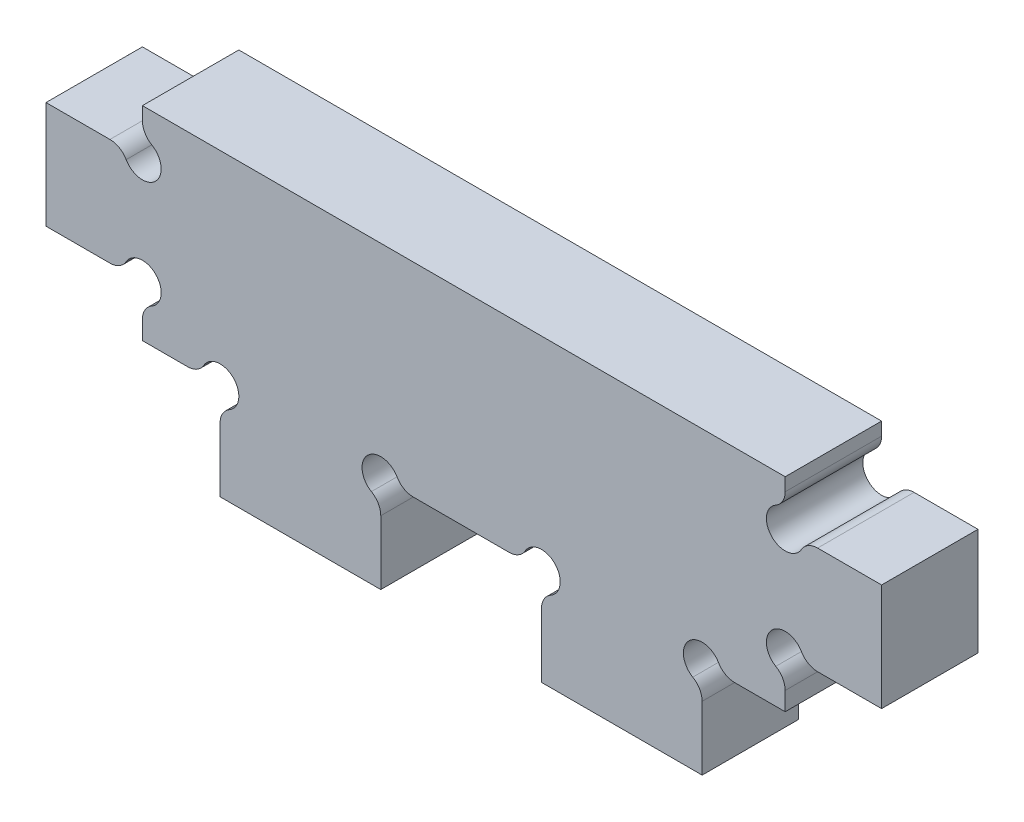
ISO-10303-21;
HEADER;
FILE_DESCRIPTION(('STEP AP214'),'2;1');
FILE_NAME('part.step','',(''),(''),'','','');
FILE_SCHEMA(('AUTOMOTIVE_DESIGN { 1 0 10303 214 1 1 1 1 }'));
ENDSEC;
DATA;
#1=APPLICATION_CONTEXT('core data for automotive mechanical design processes');
#2=APPLICATION_PROTOCOL_DEFINITION('international standard','automotive_design',2000,#1);
#3=PRODUCT_CONTEXT('',#1,'mechanical');
#4=PRODUCT('Part','Part','',(#3));
#5=PRODUCT_RELATED_PRODUCT_CATEGORY('part','',(#4));
#6=PRODUCT_DEFINITION_FORMATION('','',#4);
#7=PRODUCT_DEFINITION_CONTEXT('part definition',#1,'design');
#8=PRODUCT_DEFINITION('design','',#6,#7);
#9=PRODUCT_DEFINITION_SHAPE('','',#8);
#10=(LENGTH_UNIT() NAMED_UNIT(*) SI_UNIT(.MILLI.,.METRE.));
#11=(NAMED_UNIT(*) PLANE_ANGLE_UNIT() SI_UNIT($,.RADIAN.));
#12=(NAMED_UNIT(*) SI_UNIT($,.STERADIAN.) SOLID_ANGLE_UNIT());
#13=UNCERTAINTY_MEASURE_WITH_UNIT(LENGTH_MEASURE(1.E-05),#10,'distance_accuracy_value','');
#14=(GEOMETRIC_REPRESENTATION_CONTEXT(3) GLOBAL_UNCERTAINTY_ASSIGNED_CONTEXT((#13)) GLOBAL_UNIT_ASSIGNED_CONTEXT((#10,
#11,#12)) REPRESENTATION_CONTEXT('',''));
#15=CARTESIAN_POINT('',(0.,0.,0.));
#16=DIRECTION('',(0.,0.,1.));
#17=DIRECTION('',(1.,0.,0.));
#18=AXIS2_PLACEMENT_3D('',#15,#16,#17);
#19=CARTESIAN_POINT('',(-59.5,-19.5,18.));
#20=DIRECTION('',(0.,1.,0.));
#21=DIRECTION('',(0.,0.,1.));
#22=AXIS2_PLACEMENT_3D('',#19,#20,#21);
#23=PLANE('',#22);
#24=DIRECTION('',(1.,0.,0.));
#25=VECTOR('',#24,1.);
#26=CARTESIAN_POINT('',(-59.5,-19.5,18.));
#27=LINE('',#26,#25);
#28=CARTESIAN_POINT('',(51.0621778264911,-19.5,18.));
#29=VERTEX_POINT('',#28);
#30=CARTESIAN_POINT('',(60.5,-19.5,18.));
#31=VERTEX_POINT('',#30);
#32=EDGE_CURVE('E384',#29,#31,#27,.T.);
#33=ORIENTED_EDGE('',*,*,#32,.F.);
#34=DIRECTION('',(0.,0.,1.));
#35=VECTOR('',#34,1.);
#36=CARTESIAN_POINT('',(51.0621778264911,-19.5,18.));
#37=LINE('',#36,#35);
#38=CARTESIAN_POINT('',(51.0621778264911,-19.5,0.));
#39=VERTEX_POINT('',#38);
#40=EDGE_CURVE('E577',#29,#39,#37,.F.);
#41=ORIENTED_EDGE('',*,*,#40,.T.);
#42=DIRECTION('',(1.,0.,0.));
#43=VECTOR('',#42,1.);
#44=CARTESIAN_POINT('',(-59.5,-19.5,0.));
#45=LINE('',#44,#43);
#46=CARTESIAN_POINT('',(60.5,-19.5,0.));
#47=VERTEX_POINT('',#46);
#48=EDGE_CURVE('E413',#39,#47,#45,.T.);
#49=ORIENTED_EDGE('',*,*,#48,.T.);
#50=DIRECTION('',(0.,0.,-1.));
#51=VECTOR('',#50,1.);
#52=CARTESIAN_POINT('',(60.5,-19.5,18.));
#53=LINE('',#52,#51);
#54=EDGE_CURVE('E460',#31,#47,#53,.T.);
#55=ORIENTED_EDGE('',*,*,#54,.F.);
#56=EDGE_LOOP('',(#33,#41,#49,#55));
#57=FACE_BOUND('',#56,.T.);
#58=ADVANCED_FACE('F45',(#57),#23,.F.);
#59=CARTESIAN_POINT('',(-8.93782217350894,-19.5,0.));
#60=VERTEX_POINT('',#59);
#61=CARTESIAN_POINT('',(8.93782217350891,-19.5,0.));
#62=VERTEX_POINT('',#61);
#63=EDGE_CURVE('E418',#60,#62,#45,.T.);
#64=ORIENTED_EDGE('',*,*,#63,.T.);
#65=DIRECTION('',(0.,0.,1.));
#66=VECTOR('',#65,1.);
#67=CARTESIAN_POINT('',(8.93782217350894,-19.5,18.));
#68=LINE('',#67,#66);
#69=CARTESIAN_POINT('',(8.93782217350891,-19.5,18.));
#70=VERTEX_POINT('',#69);
#71=EDGE_CURVE('E597',#62,#70,#68,.T.);
#72=ORIENTED_EDGE('',*,*,#71,.T.);
#73=CARTESIAN_POINT('',(-8.93782217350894,-19.5,18.));
#74=VERTEX_POINT('',#73);
#75=EDGE_CURVE('E389',#74,#70,#27,.T.);
#76=ORIENTED_EDGE('',*,*,#75,.F.);
#77=DIRECTION('',(0.,0.,1.));
#78=VECTOR('',#77,1.);
#79=CARTESIAN_POINT('',(-8.93782217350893,-19.5,18.));
#80=LINE('',#79,#78);
#81=EDGE_CURVE('E594',#74,#60,#80,.F.);
#82=ORIENTED_EDGE('',*,*,#81,.T.);
#83=EDGE_LOOP('',(#64,#72,#76,#82));
#84=FACE_BOUND('',#83,.T.);
#85=ADVANCED_FACE('F758',(#84),#23,.F.);
#86=CARTESIAN_POINT('',(-59.5,-13.,18.));
#87=DIRECTION('',(1.,0.,0.));
#88=DIRECTION('',(0.,0.,-1.));
#89=AXIS2_PLACEMENT_3D('',#86,#87,#88);
#90=PLANE('',#89);
#91=DIRECTION('',(0.,-1.,0.));
#92=VECTOR('',#91,1.);
#93=CARTESIAN_POINT('',(-59.5,-13.,18.));
#94=LINE('',#93,#92);
#95=CARTESIAN_POINT('',(-59.5,-16.0621778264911,18.));
#96=VERTEX_POINT('',#95);
#97=CARTESIAN_POINT('',(-59.5,-19.5,18.));
#98=VERTEX_POINT('',#97);
#99=EDGE_CURVE('E381',#96,#98,#94,.T.);
#100=ORIENTED_EDGE('',*,*,#99,.F.);
#101=DIRECTION('',(0.,0.,1.));
#102=VECTOR('',#101,1.);
#103=CARTESIAN_POINT('',(-59.5,-16.0621778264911,18.));
#104=LINE('',#103,#102);
#105=CARTESIAN_POINT('',(-59.5,-16.0621778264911,0.));
#106=VERTEX_POINT('',#105);
#107=EDGE_CURVE('E574',#96,#106,#104,.F.);
#108=ORIENTED_EDGE('',*,*,#107,.T.);
#109=DIRECTION('',(0.,-1.,0.));
#110=VECTOR('',#109,1.);
#111=CARTESIAN_POINT('',(-59.5,-13.,0.));
#112=LINE('',#111,#110);
#113=CARTESIAN_POINT('',(-59.5,-19.5,0.));
#114=VERTEX_POINT('',#113);
#115=EDGE_CURVE('E365',#106,#114,#112,.T.);
#116=ORIENTED_EDGE('',*,*,#115,.T.);
#117=DIRECTION('',(0.,0.,-1.));
#118=VECTOR('',#117,1.);
#119=CARTESIAN_POINT('',(-59.5,-19.5,18.));
#120=LINE('',#119,#118);
#121=EDGE_CURVE('E463',#98,#114,#120,.T.);
#122=ORIENTED_EDGE('',*,*,#121,.F.);
#123=EDGE_LOOP('',(#100,#108,#116,#122));
#124=FACE_BOUND('',#123,.T.);
#125=ADVANCED_FACE('F789',(#124),#90,.F.);
#126=CARTESIAN_POINT('',(-51.0621778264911,-19.5,0.));
#127=VERTEX_POINT('',#126);
#128=EDGE_CURVE('E414',#114,#127,#45,.T.);
#129=ORIENTED_EDGE('',*,*,#128,.T.);
#130=DIRECTION('',(0.,0.,1.));
#131=VECTOR('',#130,1.);
#132=CARTESIAN_POINT('',(-51.0621778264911,-19.5,18.));
#133=LINE('',#132,#131);
#134=CARTESIAN_POINT('',(-51.0621778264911,-19.5,18.));
#135=VERTEX_POINT('',#134);
#136=EDGE_CURVE('E13',#127,#135,#133,.T.);
#137=ORIENTED_EDGE('',*,*,#136,.T.);
#138=EDGE_CURVE('E385',#98,#135,#27,.T.);
#139=ORIENTED_EDGE('',*,*,#138,.F.);
#140=ORIENTED_EDGE('',*,*,#121,.T.);
#141=EDGE_LOOP('',(#129,#137,#139,#140));
#142=FACE_BOUND('',#141,.T.);
#143=ADVANCED_FACE('F785',(#142),#23,.F.);
#144=CARTESIAN_POINT('',(60.5,-13.,18.));
#145=DIRECTION('',(-1.,0.,0.));
#146=DIRECTION('',(0.,0.,1.));
#147=AXIS2_PLACEMENT_3D('',#144,#145,#146);
#148=PLANE('',#147);
#149=DIRECTION('',(0.,1.,0.));
#150=VECTOR('',#149,1.);
#151=CARTESIAN_POINT('',(60.5,-13.,0.));
#152=LINE('',#151,#150);
#153=CARTESIAN_POINT('',(60.5,-16.0621778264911,0.));
#154=VERTEX_POINT('',#153);
#155=EDGE_CURVE('E417',#47,#154,#152,.T.);
#156=ORIENTED_EDGE('',*,*,#155,.T.);
#157=DIRECTION('',(0.,0.,1.));
#158=VECTOR('',#157,1.);
#159=CARTESIAN_POINT('',(60.5,-16.0621778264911,18.));
#160=LINE('',#159,#158);
#161=CARTESIAN_POINT('',(60.5,-16.0621778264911,18.));
#162=VERTEX_POINT('',#161);
#163=EDGE_CURVE('E544',#154,#162,#160,.T.);
#164=ORIENTED_EDGE('',*,*,#163,.T.);
#165=DIRECTION('',(0.,1.,0.));
#166=VECTOR('',#165,1.);
#167=CARTESIAN_POINT('',(60.5,-13.,18.));
#168=LINE('',#167,#166);
#169=EDGE_CURVE('E388',#31,#162,#168,.T.);
#170=ORIENTED_EDGE('',*,*,#169,.F.);
#171=ORIENTED_EDGE('',*,*,#54,.T.);
#172=EDGE_LOOP('',(#156,#164,#170,#171));
#173=FACE_BOUND('',#172,.T.);
#174=ADVANCED_FACE('F748',(#173),#148,.F.);
#175=CARTESIAN_POINT('',(78.5,-10.,18.));
#176=DIRECTION('',(0.,1.,0.));
#177=DIRECTION('',(0.,0.,1.));
#178=AXIS2_PLACEMENT_3D('',#175,#176,#177);
#179=PLANE('',#178);
#180=DIRECTION('',(1.,0.,0.));
#181=VECTOR('',#180,1.);
#182=CARTESIAN_POINT('',(60.5,-10.,18.));
#183=LINE('',#182,#181);
#184=CARTESIAN_POINT('',(66.5621778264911,-10.,18.));
#185=VERTEX_POINT('',#184);
#186=CARTESIAN_POINT('',(78.5,-10.,18.));
#187=VERTEX_POINT('',#186);
#188=EDGE_CURVE('E392',#185,#187,#183,.T.);
#189=ORIENTED_EDGE('',*,*,#188,.F.);
#190=DIRECTION('',(0.,0.,1.));
#191=VECTOR('',#190,1.);
#192=CARTESIAN_POINT('',(66.5621778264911,-10.,18.));
#193=LINE('',#192,#191);
#194=CARTESIAN_POINT('',(66.5621778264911,-10.,0.));
#195=VERTEX_POINT('',#194);
#196=EDGE_CURVE('E475',#185,#195,#193,.F.);
#197=ORIENTED_EDGE('',*,*,#196,.T.);
#198=DIRECTION('',(1.,0.,0.));
#199=VECTOR('',#198,1.);
#200=CARTESIAN_POINT('',(78.5,-10.,0.));
#201=LINE('',#200,#199);
#202=CARTESIAN_POINT('',(78.5,-10.,0.));
#203=VERTEX_POINT('',#202);
#204=EDGE_CURVE('E421',#195,#203,#201,.T.);
#205=ORIENTED_EDGE('',*,*,#204,.T.);
#206=DIRECTION('',(0.,0.,-1.));
#207=VECTOR('',#206,1.);
#208=CARTESIAN_POINT('',(78.5,-10.,18.));
#209=LINE('',#208,#207);
#210=EDGE_CURVE('E457',#187,#203,#209,.T.);
#211=ORIENTED_EDGE('',*,*,#210,.F.);
#212=EDGE_LOOP('',(#189,#197,#205,#211));
#213=FACE_BOUND('',#212,.T.);
#214=ADVANCED_FACE('F732',(#213),#179,.F.);
#215=CARTESIAN_POINT('',(78.5,-10.,18.));
#216=DIRECTION('',(-1.,0.,0.));
#217=DIRECTION('',(0.,0.,1.));
#218=AXIS2_PLACEMENT_3D('',#215,#216,#217);
#219=PLANE('',#218);
#220=DIRECTION('',(0.,1.,0.));
#221=VECTOR('',#220,1.);
#222=CARTESIAN_POINT('',(78.5,-10.,0.));
#223=LINE('',#222,#221);
#224=CARTESIAN_POINT('',(78.5,10.,0.));
#225=VERTEX_POINT('',#224);
#226=EDGE_CURVE('E423',#203,#225,#223,.T.);
#227=ORIENTED_EDGE('',*,*,#226,.T.);
#228=DIRECTION('',(0.,0.,-1.));
#229=VECTOR('',#228,1.);
#230=CARTESIAN_POINT('',(78.5,10.,18.));
#231=LINE('',#230,#229);
#232=CARTESIAN_POINT('',(78.5,10.,18.));
#233=VERTEX_POINT('',#232);
#234=EDGE_CURVE('E454',#233,#225,#231,.T.);
#235=ORIENTED_EDGE('',*,*,#234,.F.);
#236=DIRECTION('',(0.,1.,0.));
#237=VECTOR('',#236,1.);
#238=CARTESIAN_POINT('',(78.5,-10.,18.));
#239=LINE('',#238,#237);
#240=EDGE_CURVE('E394',#187,#233,#239,.T.);
#241=ORIENTED_EDGE('',*,*,#240,.F.);
#242=ORIENTED_EDGE('',*,*,#210,.T.);
#243=EDGE_LOOP('',(#227,#235,#241,#242));
#244=FACE_BOUND('',#243,.T.);
#245=ADVANCED_FACE('F727',(#244),#219,.F.);
#246=CARTESIAN_POINT('',(60.5,10.,18.));
#247=DIRECTION('',(0.,-1.,0.));
#248=DIRECTION('',(0.,0.,-1.));
#249=AXIS2_PLACEMENT_3D('',#246,#247,#248);
#250=PLANE('',#249);
#251=DIRECTION('',(-1.,0.,0.));
#252=VECTOR('',#251,1.);
#253=CARTESIAN_POINT('',(60.5,10.,0.));
#254=LINE('',#253,#252);
#255=CARTESIAN_POINT('',(66.562177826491,10.,0.));
#256=VERTEX_POINT('',#255);
#257=EDGE_CURVE('E426',#225,#256,#254,.T.);
#258=ORIENTED_EDGE('',*,*,#257,.T.);
#259=DIRECTION('',(0.,0.,1.));
#260=VECTOR('',#259,1.);
#261=CARTESIAN_POINT('',(66.562177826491,10.,18.));
#262=LINE('',#261,#260);
#263=CARTESIAN_POINT('',(66.562177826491,10.,18.));
#264=VERTEX_POINT('',#263);
#265=EDGE_CURVE('E547',#256,#264,#262,.T.);
#266=ORIENTED_EDGE('',*,*,#265,.T.);
#267=DIRECTION('',(-1.,0.,0.));
#268=VECTOR('',#267,1.);
#269=CARTESIAN_POINT('',(78.5,10.,18.));
#270=LINE('',#269,#268);
#271=EDGE_CURVE('E396',#233,#264,#270,.T.);
#272=ORIENTED_EDGE('',*,*,#271,.F.);
#273=ORIENTED_EDGE('',*,*,#234,.T.);
#274=EDGE_LOOP('',(#258,#266,#272,#273));
#275=FACE_BOUND('',#274,.T.);
#276=ADVANCED_FACE('F723',(#275),#250,.F.);
#277=CARTESIAN_POINT('',(60.5,11.6583123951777,18.));
#278=DIRECTION('',(-1.,0.,0.));
#279=DIRECTION('',(0.,0.,1.));
#280=AXIS2_PLACEMENT_3D('',#277,#278,#279);
#281=PLANE('',#280);
#282=DIRECTION('',(0.,1.,0.));
#283=VECTOR('',#282,1.);
#284=CARTESIAN_POINT('',(60.5,11.6583123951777,18.));
#285=LINE('',#284,#283);
#286=CARTESIAN_POINT('',(60.5,16.0621778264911,18.));
#287=VERTEX_POINT('',#286);
#288=CARTESIAN_POINT('',(60.5,18.5,18.));
#289=VERTEX_POINT('',#288);
#290=EDGE_CURVE('E399',#287,#289,#285,.T.);
#291=ORIENTED_EDGE('',*,*,#290,.F.);
#292=DIRECTION('',(0.,0.,1.));
#293=VECTOR('',#292,1.);
#294=CARTESIAN_POINT('',(60.5,16.0621778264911,18.));
#295=LINE('',#294,#293);
#296=CARTESIAN_POINT('',(60.5,16.0621778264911,0.));
#297=VERTEX_POINT('',#296);
#298=EDGE_CURVE('E554',#287,#297,#295,.F.);
#299=ORIENTED_EDGE('',*,*,#298,.T.);
#300=DIRECTION('',(0.,1.,0.));
#301=VECTOR('',#300,1.);
#302=CARTESIAN_POINT('',(60.5,11.6583123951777,0.));
#303=LINE('',#302,#301);
#304=CARTESIAN_POINT('',(60.5,18.5,0.));
#305=VERTEX_POINT('',#304);
#306=EDGE_CURVE('E429',#297,#305,#303,.T.);
#307=ORIENTED_EDGE('',*,*,#306,.T.);
#308=DIRECTION('',(0.,0.,-1.));
#309=VECTOR('',#308,1.);
#310=CARTESIAN_POINT('',(60.5,18.5,18.));
#311=LINE('',#310,#309);
#312=EDGE_CURVE('E451',#289,#305,#311,.T.);
#313=ORIENTED_EDGE('',*,*,#312,.F.);
#314=EDGE_LOOP('',(#291,#299,#307,#313));
#315=FACE_BOUND('',#314,.T.);
#316=ADVANCED_FACE('F707',(#315),#281,.F.);
#317=CARTESIAN_POINT('',(-59.5,18.5,18.));
#318=DIRECTION('',(0.,-1.,0.));
#319=DIRECTION('',(0.,0.,-1.));
#320=AXIS2_PLACEMENT_3D('',#317,#318,#319);
#321=PLANE('',#320);
#322=DIRECTION('',(-1.,0.,0.));
#323=VECTOR('',#322,1.);
#324=CARTESIAN_POINT('',(-59.5,18.5,0.));
#325=LINE('',#324,#323);
#326=CARTESIAN_POINT('',(-59.5,18.5,0.));
#327=VERTEX_POINT('',#326);
#328=EDGE_CURVE('E431',#305,#327,#325,.T.);
#329=ORIENTED_EDGE('',*,*,#328,.T.);
#330=DIRECTION('',(0.,0.,-1.));
#331=VECTOR('',#330,1.);
#332=CARTESIAN_POINT('',(-59.5,18.5,18.));
#333=LINE('',#332,#331);
#334=CARTESIAN_POINT('',(-59.5,18.5,18.));
#335=VERTEX_POINT('',#334);
#336=EDGE_CURVE('E448',#335,#327,#333,.T.);
#337=ORIENTED_EDGE('',*,*,#336,.F.);
#338=DIRECTION('',(-1.,0.,0.));
#339=VECTOR('',#338,1.);
#340=CARTESIAN_POINT('',(-59.5,18.5,18.));
#341=LINE('',#340,#339);
#342=EDGE_CURVE('E401',#289,#335,#341,.T.);
#343=ORIENTED_EDGE('',*,*,#342,.F.);
#344=ORIENTED_EDGE('',*,*,#312,.T.);
#345=EDGE_LOOP('',(#329,#337,#343,#344));
#346=FACE_BOUND('',#345,.T.);
#347=ADVANCED_FACE('F701',(#346),#321,.F.);
#348=CARTESIAN_POINT('',(-59.5,11.6583123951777,18.));
#349=DIRECTION('',(1.,0.,0.));
#350=DIRECTION('',(0.,0.,-1.));
#351=AXIS2_PLACEMENT_3D('',#348,#349,#350);
#352=PLANE('',#351);
#353=DIRECTION('',(0.,-1.,0.));
#354=VECTOR('',#353,1.);
#355=CARTESIAN_POINT('',(-59.5,11.6583123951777,0.));
#356=LINE('',#355,#354);
#357=CARTESIAN_POINT('',(-59.5,16.0621778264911,0.));
#358=VERTEX_POINT('',#357);
#359=EDGE_CURVE('E434',#327,#358,#356,.T.);
#360=ORIENTED_EDGE('',*,*,#359,.T.);
#361=DIRECTION('',(0.,0.,1.));
#362=VECTOR('',#361,1.);
#363=CARTESIAN_POINT('',(-59.5,16.0621778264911,18.));
#364=LINE('',#363,#362);
#365=CARTESIAN_POINT('',(-59.5,16.0621778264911,18.));
#366=VERTEX_POINT('',#365);
#367=EDGE_CURVE('E557',#358,#366,#364,.T.);
#368=ORIENTED_EDGE('',*,*,#367,.T.);
#369=DIRECTION('',(0.,-1.,0.));
#370=VECTOR('',#369,1.);
#371=CARTESIAN_POINT('',(-59.5,11.6583123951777,18.));
#372=LINE('',#371,#370);
#373=EDGE_CURVE('E403',#335,#366,#372,.T.);
#374=ORIENTED_EDGE('',*,*,#373,.F.);
#375=ORIENTED_EDGE('',*,*,#336,.T.);
#376=EDGE_LOOP('',(#360,#368,#374,#375));
#377=FACE_BOUND('',#376,.T.);
#378=ADVANCED_FACE('F696',(#377),#352,.F.);
#379=CARTESIAN_POINT('',(-77.5,10.,18.));
#380=DIRECTION('',(0.,-1.,0.));
#381=DIRECTION('',(0.,0.,-1.));
#382=AXIS2_PLACEMENT_3D('',#379,#380,#381);
#383=PLANE('',#382);
#384=DIRECTION('',(-1.,0.,0.));
#385=VECTOR('',#384,1.);
#386=CARTESIAN_POINT('',(-59.5,10.,18.));
#387=LINE('',#386,#385);
#388=CARTESIAN_POINT('',(-65.5621778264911,10.,18.));
#389=VERTEX_POINT('',#388);
#390=CARTESIAN_POINT('',(-77.5,10.,18.));
#391=VERTEX_POINT('',#390);
#392=EDGE_CURVE('E406',#389,#391,#387,.T.);
#393=ORIENTED_EDGE('',*,*,#392,.F.);
#394=DIRECTION('',(0.,0.,1.));
#395=VECTOR('',#394,1.);
#396=CARTESIAN_POINT('',(-65.5621778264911,10.,18.));
#397=LINE('',#396,#395);
#398=CARTESIAN_POINT('',(-65.5621778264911,10.,0.));
#399=VERTEX_POINT('',#398);
#400=EDGE_CURVE('E564',#389,#399,#397,.F.);
#401=ORIENTED_EDGE('',*,*,#400,.T.);
#402=DIRECTION('',(-1.,0.,0.));
#403=VECTOR('',#402,1.);
#404=CARTESIAN_POINT('',(-77.5,10.,0.));
#405=LINE('',#404,#403);
#406=CARTESIAN_POINT('',(-77.5,10.,0.));
#407=VERTEX_POINT('',#406);
#408=EDGE_CURVE('E437',#399,#407,#405,.T.);
#409=ORIENTED_EDGE('',*,*,#408,.T.);
#410=DIRECTION('',(0.,0.,-1.));
#411=VECTOR('',#410,1.);
#412=CARTESIAN_POINT('',(-77.5,10.,18.));
#413=LINE('',#412,#411);
#414=EDGE_CURVE('E445',#391,#407,#413,.T.);
#415=ORIENTED_EDGE('',*,*,#414,.F.);
#416=EDGE_LOOP('',(#393,#401,#409,#415));
#417=FACE_BOUND('',#416,.T.);
#418=ADVANCED_FACE('F898',(#417),#383,.F.);
#419=CARTESIAN_POINT('',(-77.5,-10.,18.));
#420=DIRECTION('',(1.,0.,0.));
#421=DIRECTION('',(0.,0.,-1.));
#422=AXIS2_PLACEMENT_3D('',#419,#420,#421);
#423=PLANE('',#422);
#424=DIRECTION('',(0.,-1.,0.));
#425=VECTOR('',#424,1.);
#426=CARTESIAN_POINT('',(-77.5,-10.,0.));
#427=LINE('',#426,#425);
#428=CARTESIAN_POINT('',(-77.5,-10.,0.));
#429=VERTEX_POINT('',#428);
#430=EDGE_CURVE('E439',#407,#429,#427,.T.);
#431=ORIENTED_EDGE('',*,*,#430,.T.);
#432=DIRECTION('',(0.,0.,-1.));
#433=VECTOR('',#432,1.);
#434=CARTESIAN_POINT('',(-77.5,-10.,18.));
#435=LINE('',#434,#433);
#436=CARTESIAN_POINT('',(-77.5,-10.,18.));
#437=VERTEX_POINT('',#436);
#438=EDGE_CURVE('E411',#437,#429,#435,.T.);
#439=ORIENTED_EDGE('',*,*,#438,.F.);
#440=DIRECTION('',(0.,-1.,0.));
#441=VECTOR('',#440,1.);
#442=CARTESIAN_POINT('',(-77.5,-10.,18.));
#443=LINE('',#442,#441);
#444=EDGE_CURVE('E408',#391,#437,#443,.T.);
#445=ORIENTED_EDGE('',*,*,#444,.F.);
#446=ORIENTED_EDGE('',*,*,#414,.T.);
#447=EDGE_LOOP('',(#431,#439,#445,#446));
#448=FACE_BOUND('',#447,.T.);
#449=ADVANCED_FACE('F894',(#448),#423,.F.);
#450=CARTESIAN_POINT('',(-77.5,-10.,18.));
#451=DIRECTION('',(0.,1.,0.));
#452=DIRECTION('',(0.,0.,1.));
#453=AXIS2_PLACEMENT_3D('',#450,#451,#452);
#454=PLANE('',#453);
#455=DIRECTION('',(1.,0.,0.));
#456=VECTOR('',#455,1.);
#457=CARTESIAN_POINT('',(-77.5,-10.,0.));
#458=LINE('',#457,#456);
#459=CARTESIAN_POINT('',(-65.5621778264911,-10.,0.));
#460=VERTEX_POINT('',#459);
#461=EDGE_CURVE('E382',#429,#460,#458,.T.);
#462=ORIENTED_EDGE('',*,*,#461,.T.);
#463=DIRECTION('',(0.,0.,1.));
#464=VECTOR('',#463,1.);
#465=CARTESIAN_POINT('',(-65.5621778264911,-10.,18.));
#466=LINE('',#465,#464);
#467=CARTESIAN_POINT('',(-65.5621778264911,-10.,18.));
#468=VERTEX_POINT('',#467);
#469=EDGE_CURVE('E567',#460,#468,#466,.T.);
#470=ORIENTED_EDGE('',*,*,#469,.T.);
#471=DIRECTION('',(1.,0.,0.));
#472=VECTOR('',#471,1.);
#473=CARTESIAN_POINT('',(-62.5,-10.,18.));
#474=LINE('',#473,#472);
#475=EDGE_CURVE('E378',#437,#468,#474,.T.);
#476=ORIENTED_EDGE('',*,*,#475,.F.);
#477=ORIENTED_EDGE('',*,*,#438,.T.);
#478=EDGE_LOOP('',(#462,#470,#476,#477));
#479=FACE_BOUND('',#478,.T.);
#480=ADVANCED_FACE('F889',(#479),#454,.F.);
#481=CARTESIAN_POINT('',(0.,0.,18.));
#482=DIRECTION('',(0.,0.,1.));
#483=DIRECTION('',(1.,0.,0.));
#484=AXIS2_PLACEMENT_3D('',#481,#482,#483);
#485=PLANE('',#484);
#486=CARTESIAN_POINT('',(60.5,-10.,18.));
#487=DIRECTION('',(0.,0.,1.));
#488=DIRECTION('',(1.,0.,0.));
#489=AXIS2_PLACEMENT_3D('',#486,#487,#488);
#490=CIRCLE('',#489,3.50000000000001);
#491=CARTESIAN_POINT('',(63.5310889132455,-8.25,18.));
#492=VERTEX_POINT('',#491);
#493=CARTESIAN_POINT('',(58.75,-13.0310889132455,18.));
#494=VERTEX_POINT('',#493);
#495=EDGE_CURVE('E674',#492,#494,#490,.T.);
#496=ORIENTED_EDGE('',*,*,#495,.F.);
#497=CARTESIAN_POINT('',(66.5621778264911,-6.5,18.));
#498=DIRECTION('',(0.,0.,1.));
#499=DIRECTION('',(1.,0.,0.));
#500=AXIS2_PLACEMENT_3D('',#497,#498,#499);
#501=CIRCLE('',#500,3.5);
#502=EDGE_CURVE('E542',#492,#185,#501,.T.);
#503=ORIENTED_EDGE('',*,*,#502,.T.);
#504=ORIENTED_EDGE('',*,*,#188,.T.);
#505=ORIENTED_EDGE('',*,*,#240,.T.);
#506=ORIENTED_EDGE('',*,*,#271,.T.);
#507=CARTESIAN_POINT('',(66.562177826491,6.5,18.));
#508=DIRECTION('',(0.,0.,1.));
#509=DIRECTION('',(1.,0.,0.));
#510=AXIS2_PLACEMENT_3D('',#507,#508,#509);
#511=CIRCLE('',#510,3.5);
#512=CARTESIAN_POINT('',(63.5310889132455,8.24999999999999,18.));
#513=VERTEX_POINT('',#512);
#514=EDGE_CURVE('E538',#264,#513,#511,.T.);
#515=ORIENTED_EDGE('',*,*,#514,.T.);
#516=CARTESIAN_POINT('',(60.5,10.,18.));
#517=DIRECTION('',(0.,0.,1.));
#518=DIRECTION('',(1.,0.,0.));
#519=AXIS2_PLACEMENT_3D('',#516,#517,#518);
#520=CIRCLE('',#519,3.50000000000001);
#521=CARTESIAN_POINT('',(58.75,13.0310889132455,18.));
#522=VERTEX_POINT('',#521);
#523=EDGE_CURVE('E677',#522,#513,#520,.T.);
#524=ORIENTED_EDGE('',*,*,#523,.F.);
#525=CARTESIAN_POINT('',(57.,16.0621778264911,18.));
#526=DIRECTION('',(0.,0.,1.));
#527=DIRECTION('',(1.,0.,0.));
#528=AXIS2_PLACEMENT_3D('',#525,#526,#527);
#529=CIRCLE('',#528,3.5);
#530=EDGE_CURVE('E536',#522,#287,#529,.T.);
#531=ORIENTED_EDGE('',*,*,#530,.T.);
#532=ORIENTED_EDGE('',*,*,#290,.T.);
#533=ORIENTED_EDGE('',*,*,#342,.T.);
#534=ORIENTED_EDGE('',*,*,#373,.T.);
#535=CARTESIAN_POINT('',(-56.,16.0621778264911,18.));
#536=DIRECTION('',(0.,0.,1.));
#537=DIRECTION('',(1.,0.,0.));
#538=AXIS2_PLACEMENT_3D('',#535,#536,#537);
#539=CIRCLE('',#538,3.5);
#540=CARTESIAN_POINT('',(-57.75,13.0310889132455,18.));
#541=VERTEX_POINT('',#540);
#542=EDGE_CURVE('E534',#366,#541,#539,.T.);
#543=ORIENTED_EDGE('',*,*,#542,.T.);
#544=CARTESIAN_POINT('',(-59.5,10.,18.));
#545=DIRECTION('',(0.,0.,1.));
#546=DIRECTION('',(1.,0.,0.));
#547=AXIS2_PLACEMENT_3D('',#544,#545,#546);
#548=CIRCLE('',#547,3.5);
#549=CARTESIAN_POINT('',(-62.5310889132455,8.25,18.));
#550=VERTEX_POINT('',#549);
#551=EDGE_CURVE('E632',#550,#541,#548,.T.);
#552=ORIENTED_EDGE('',*,*,#551,.F.);
#553=CARTESIAN_POINT('',(-65.5621778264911,6.5,18.));
#554=DIRECTION('',(0.,0.,1.));
#555=DIRECTION('',(1.,0.,0.));
#556=AXIS2_PLACEMENT_3D('',#553,#554,#555);
#557=CIRCLE('',#556,3.5);
#558=EDGE_CURVE('E532',#550,#389,#557,.T.);
#559=ORIENTED_EDGE('',*,*,#558,.T.);
#560=ORIENTED_EDGE('',*,*,#392,.T.);
#561=ORIENTED_EDGE('',*,*,#444,.T.);
#562=ORIENTED_EDGE('',*,*,#475,.T.);
#563=CARTESIAN_POINT('',(-65.5621778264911,-6.5,18.));
#564=DIRECTION('',(0.,0.,1.));
#565=DIRECTION('',(1.,0.,0.));
#566=AXIS2_PLACEMENT_3D('',#563,#564,#565);
#567=CIRCLE('',#566,3.5);
#568=CARTESIAN_POINT('',(-62.5310889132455,-8.25,18.));
#569=VERTEX_POINT('',#568);
#570=EDGE_CURVE('E530',#468,#569,#567,.T.);
#571=ORIENTED_EDGE('',*,*,#570,.T.);
#572=CARTESIAN_POINT('',(-59.5,-10.,18.));
#573=DIRECTION('',(0.,0.,1.));
#574=DIRECTION('',(1.,0.,0.));
#575=AXIS2_PLACEMENT_3D('',#572,#573,#574);
#576=CIRCLE('',#575,3.5);
#577=CARTESIAN_POINT('',(-57.75,-13.0310889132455,18.));
#578=VERTEX_POINT('',#577);
#579=EDGE_CURVE('E680',#578,#569,#576,.T.);
#580=ORIENTED_EDGE('',*,*,#579,.F.);
#581=CARTESIAN_POINT('',(-56.,-16.0621778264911,18.));
#582=DIRECTION('',(0.,0.,1.));
#583=DIRECTION('',(1.,0.,0.));
#584=AXIS2_PLACEMENT_3D('',#581,#582,#583);
#585=CIRCLE('',#584,3.5);
#586=EDGE_CURVE('E528',#578,#96,#585,.T.);
#587=ORIENTED_EDGE('',*,*,#586,.T.);
#588=ORIENTED_EDGE('',*,*,#99,.T.);
#589=ORIENTED_EDGE('',*,*,#138,.T.);
#590=CARTESIAN_POINT('',(-51.0621778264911,-16.,18.));
#591=DIRECTION('',(0.,0.,1.));
#592=DIRECTION('',(1.,0.,0.));
#593=AXIS2_PLACEMENT_3D('',#590,#591,#592);
#594=CIRCLE('',#593,3.5);
#595=CARTESIAN_POINT('',(-48.0310889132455,-17.75,18.));
#596=VERTEX_POINT('',#595);
#597=EDGE_CURVE('E514',#135,#596,#594,.T.);
#598=ORIENTED_EDGE('',*,*,#597,.T.);
#599=CARTESIAN_POINT('',(-45.,-19.5,18.));
#600=DIRECTION('',(0.,0.,1.));
#601=DIRECTION('',(1.,0.,0.));
#602=AXIS2_PLACEMENT_3D('',#599,#600,#601);
#603=CIRCLE('',#602,3.5);
#604=CARTESIAN_POINT('',(-43.25,-22.5310889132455,18.));
#605=VERTEX_POINT('',#604);
#606=EDGE_CURVE('E628',#605,#596,#603,.T.);
#607=ORIENTED_EDGE('',*,*,#606,.F.);
#608=CARTESIAN_POINT('',(-41.5,-25.5621778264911,18.));
#609=DIRECTION('',(0.,0.,1.));
#610=DIRECTION('',(1.,0.,0.));
#611=AXIS2_PLACEMENT_3D('',#608,#609,#610);
#612=CIRCLE('',#611,3.5);
#613=CARTESIAN_POINT('',(-45.,-25.5621778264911,18.));
#614=VERTEX_POINT('',#613);
#615=EDGE_CURVE('E68',#605,#614,#612,.T.);
#616=ORIENTED_EDGE('',*,*,#615,.T.);
#617=DIRECTION('',(0.,-1.,0.));
#618=VECTOR('',#617,1.);
#619=CARTESIAN_POINT('',(-45.,-1.5,18.));
#620=LINE('',#619,#618);
#621=CARTESIAN_POINT('',(-45.,-37.5,18.));
#622=VERTEX_POINT('',#621);
#623=EDGE_CURVE('E368',#614,#622,#620,.T.);
#624=ORIENTED_EDGE('',*,*,#623,.T.);
#625=DIRECTION('',(1.,0.,0.));
#626=VECTOR('',#625,1.);
#627=CARTESIAN_POINT('',(-45.,-37.5,18.));
#628=LINE('',#627,#626);
#629=CARTESIAN_POINT('',(-15.,-37.5,18.));
#630=VERTEX_POINT('',#629);
#631=EDGE_CURVE('E371',#622,#630,#628,.T.);
#632=ORIENTED_EDGE('',*,*,#631,.T.);
#633=DIRECTION('',(0.,1.,0.));
#634=VECTOR('',#633,1.);
#635=CARTESIAN_POINT('',(-15.,-1.5,18.));
#636=LINE('',#635,#634);
#637=CARTESIAN_POINT('',(-15.,-25.5621778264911,18.));
#638=VERTEX_POINT('',#637);
#639=EDGE_CURVE('E366',#630,#638,#636,.T.);
#640=ORIENTED_EDGE('',*,*,#639,.T.);
#641=CARTESIAN_POINT('',(-18.5,-25.5621778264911,18.));
#642=DIRECTION('',(0.,0.,1.));
#643=DIRECTION('',(1.,0.,0.));
#644=AXIS2_PLACEMENT_3D('',#641,#642,#643);
#645=CIRCLE('',#644,3.5);
#646=CARTESIAN_POINT('',(-16.75,-22.5310889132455,18.));
#647=VERTEX_POINT('',#646);
#648=EDGE_CURVE('E517',#638,#647,#645,.T.);
#649=ORIENTED_EDGE('',*,*,#648,.T.);
#650=CARTESIAN_POINT('',(-15.,-19.5,18.));
#651=DIRECTION('',(0.,0.,1.));
#652=DIRECTION('',(1.,0.,0.));
#653=AXIS2_PLACEMENT_3D('',#650,#651,#652);
#654=CIRCLE('',#653,3.5);
#655=CARTESIAN_POINT('',(-11.9689110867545,-17.75,18.));
#656=VERTEX_POINT('',#655);
#657=EDGE_CURVE('E671',#656,#647,#654,.T.);
#658=ORIENTED_EDGE('',*,*,#657,.F.);
#659=CARTESIAN_POINT('',(-8.93782217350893,-16.,18.));
#660=DIRECTION('',(0.,0.,1.));
#661=DIRECTION('',(1.,0.,0.));
#662=AXIS2_PLACEMENT_3D('',#659,#660,#661);
#663=CIRCLE('',#662,3.5);
#664=EDGE_CURVE('E519',#656,#74,#663,.T.);
#665=ORIENTED_EDGE('',*,*,#664,.T.);
#666=ORIENTED_EDGE('',*,*,#75,.T.);
#667=CARTESIAN_POINT('',(8.93782217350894,-16.,18.));
#668=DIRECTION('',(0.,0.,1.));
#669=DIRECTION('',(1.,0.,0.));
#670=AXIS2_PLACEMENT_3D('',#667,#668,#669);
#671=CIRCLE('',#670,3.5);
#672=CARTESIAN_POINT('',(11.9689110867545,-17.75,18.));
#673=VERTEX_POINT('',#672);
#674=EDGE_CURVE('E521',#70,#673,#671,.T.);
#675=ORIENTED_EDGE('',*,*,#674,.T.);
#676=CARTESIAN_POINT('',(15.,-19.5,18.));
#677=DIRECTION('',(0.,0.,1.));
#678=DIRECTION('',(1.,0.,0.));
#679=AXIS2_PLACEMENT_3D('',#676,#677,#678);
#680=CIRCLE('',#679,3.5);
#681=CARTESIAN_POINT('',(16.75,-22.5310889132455,18.));
#682=VERTEX_POINT('',#681);
#683=EDGE_CURVE('E667',#682,#673,#680,.T.);
#684=ORIENTED_EDGE('',*,*,#683,.F.);
#685=CARTESIAN_POINT('',(18.5,-25.5621778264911,18.));
#686=DIRECTION('',(0.,0.,1.));
#687=DIRECTION('',(1.,0.,0.));
#688=AXIS2_PLACEMENT_3D('',#685,#686,#687);
#689=CIRCLE('',#688,3.5);
#690=CARTESIAN_POINT('',(15.,-25.5621778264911,18.));
#691=VERTEX_POINT('',#690);
#692=EDGE_CURVE('E335',#682,#691,#689,.T.);
#693=ORIENTED_EDGE('',*,*,#692,.T.);
#694=DIRECTION('',(0.,-1.,0.));
#695=VECTOR('',#694,1.);
#696=CARTESIAN_POINT('',(15.,-1.5,18.));
#697=LINE('',#696,#695);
#698=CARTESIAN_POINT('',(15.,-37.5,18.));
#699=VERTEX_POINT('',#698);
#700=EDGE_CURVE('E327',#691,#699,#697,.T.);
#701=ORIENTED_EDGE('',*,*,#700,.T.);
#702=DIRECTION('',(1.,0.,0.));
#703=VECTOR('',#702,1.);
#704=CARTESIAN_POINT('',(45.,-37.5,18.));
#705=LINE('',#704,#703);
#706=CARTESIAN_POINT('',(45.,-37.5,18.));
#707=VERTEX_POINT('',#706);
#708=EDGE_CURVE('E333',#699,#707,#705,.T.);
#709=ORIENTED_EDGE('',*,*,#708,.T.);
#710=DIRECTION('',(0.,1.,0.));
#711=VECTOR('',#710,1.);
#712=CARTESIAN_POINT('',(45.,-1.5,18.));
#713=LINE('',#712,#711);
#714=CARTESIAN_POINT('',(45.,-25.5621778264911,18.));
#715=VERTEX_POINT('',#714);
#716=EDGE_CURVE('E338',#707,#715,#713,.T.);
#717=ORIENTED_EDGE('',*,*,#716,.T.);
#718=CARTESIAN_POINT('',(41.5,-25.5621778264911,18.));
#719=DIRECTION('',(0.,0.,1.));
#720=DIRECTION('',(1.,0.,0.));
#721=AXIS2_PLACEMENT_3D('',#718,#719,#720);
#722=CIRCLE('',#721,3.5);
#723=CARTESIAN_POINT('',(43.25,-22.5310889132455,18.));
#724=VERTEX_POINT('',#723);
#725=EDGE_CURVE('E524',#715,#724,#722,.T.);
#726=ORIENTED_EDGE('',*,*,#725,.T.);
#727=CARTESIAN_POINT('',(45.,-19.5,18.));
#728=DIRECTION('',(0.,0.,1.));
#729=DIRECTION('',(1.,0.,0.));
#730=AXIS2_PLACEMENT_3D('',#727,#728,#729);
#731=CIRCLE('',#730,3.5);
#732=CARTESIAN_POINT('',(48.0310889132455,-17.75,18.));
#733=VERTEX_POINT('',#732);
#734=EDGE_CURVE('E655',#733,#724,#731,.T.);
#735=ORIENTED_EDGE('',*,*,#734,.F.);
#736=CARTESIAN_POINT('',(51.0621778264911,-16.,18.));
#737=DIRECTION('',(0.,0.,1.));
#738=DIRECTION('',(1.,0.,0.));
#739=AXIS2_PLACEMENT_3D('',#736,#737,#738);
#740=CIRCLE('',#739,3.5);
#741=EDGE_CURVE('E526',#733,#29,#740,.T.);
#742=ORIENTED_EDGE('',*,*,#741,.T.);
#743=ORIENTED_EDGE('',*,*,#32,.T.);
#744=ORIENTED_EDGE('',*,*,#169,.T.);
#745=CARTESIAN_POINT('',(57.,-16.0621778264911,18.));
#746=DIRECTION('',(0.,0.,1.));
#747=DIRECTION('',(1.,0.,0.));
#748=AXIS2_PLACEMENT_3D('',#745,#746,#747);
#749=CIRCLE('',#748,3.5);
#750=EDGE_CURVE('E540',#162,#494,#749,.T.);
#751=ORIENTED_EDGE('',*,*,#750,.T.);
#752=EDGE_LOOP('',(#496,#503,#504,#505,#506,#515,#524,#531,#532,#533,#534,#543,#552,#559,#560,
#561,#562,#571,#580,#587,#588,#589,#598,#607,#616,#624,#632,#640,#649,#658,#665,#666,#675,#684,
#693,#701,#709,#717,#726,#735,#742,#743,#744,#751));
#753=FACE_BOUND('',#752,.T.);
#754=ADVANCED_FACE('F330',(#753),#485,.T.);
#755=CARTESIAN_POINT('',(0.,0.,0.));
#756=DIRECTION('',(0.,0.,1.));
#757=DIRECTION('',(1.,0.,0.));
#758=AXIS2_PLACEMENT_3D('',#755,#756,#757);
#759=PLANE('',#758);
#760=ORIENTED_EDGE('',*,*,#204,.F.);
#761=CARTESIAN_POINT('',(66.5621778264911,-6.5,0.));
#762=DIRECTION('',(0.,0.,1.));
#763=DIRECTION('',(1.,0.,0.));
#764=AXIS2_PLACEMENT_3D('',#761,#762,#763);
#765=CIRCLE('',#764,3.5);
#766=CARTESIAN_POINT('',(63.5310889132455,-8.25,0.));
#767=VERTEX_POINT('',#766);
#768=EDGE_CURVE('E508',#195,#767,#765,.F.);
#769=ORIENTED_EDGE('',*,*,#768,.T.);
#770=CARTESIAN_POINT('',(60.5,-10.,0.));
#771=DIRECTION('',(0.,0.,1.));
#772=DIRECTION('',(1.,0.,0.));
#773=AXIS2_PLACEMENT_3D('',#770,#771,#772);
#774=CIRCLE('',#773,3.50000000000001);
#775=CARTESIAN_POINT('',(58.75,-13.0310889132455,0.));
#776=VERTEX_POINT('',#775);
#777=EDGE_CURVE('E658',#767,#776,#774,.T.);
#778=ORIENTED_EDGE('',*,*,#777,.T.);
#779=CARTESIAN_POINT('',(57.,-16.0621778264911,0.));
#780=DIRECTION('',(0.,0.,1.));
#781=DIRECTION('',(1.,0.,0.));
#782=AXIS2_PLACEMENT_3D('',#779,#780,#781);
#783=CIRCLE('',#782,3.5);
#784=EDGE_CURVE('E506',#776,#154,#783,.F.);
#785=ORIENTED_EDGE('',*,*,#784,.T.);
#786=ORIENTED_EDGE('',*,*,#155,.F.);
#787=ORIENTED_EDGE('',*,*,#48,.F.);
#788=CARTESIAN_POINT('',(51.0621778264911,-16.,0.));
#789=DIRECTION('',(0.,0.,1.));
#790=DIRECTION('',(1.,0.,0.));
#791=AXIS2_PLACEMENT_3D('',#788,#789,#790);
#792=CIRCLE('',#791,3.5);
#793=CARTESIAN_POINT('',(48.0310889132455,-17.75,0.));
#794=VERTEX_POINT('',#793);
#795=EDGE_CURVE('E492',#39,#794,#792,.F.);
#796=ORIENTED_EDGE('',*,*,#795,.T.);
#797=CARTESIAN_POINT('',(45.,-19.5,0.));
#798=DIRECTION('',(0.,0.,1.));
#799=DIRECTION('',(1.,0.,0.));
#800=AXIS2_PLACEMENT_3D('',#797,#798,#799);
#801=CIRCLE('',#800,3.5);
#802=CARTESIAN_POINT('',(43.25,-22.5310889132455,0.));
#803=VERTEX_POINT('',#802);
#804=EDGE_CURVE('E653',#794,#803,#801,.T.);
#805=ORIENTED_EDGE('',*,*,#804,.T.);
#806=CARTESIAN_POINT('',(41.5,-25.5621778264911,0.));
#807=DIRECTION('',(0.,0.,1.));
#808=DIRECTION('',(1.,0.,0.));
#809=AXIS2_PLACEMENT_3D('',#806,#807,#808);
#810=CIRCLE('',#809,3.5);
#811=CARTESIAN_POINT('',(45.,-25.5621778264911,0.));
#812=VERTEX_POINT('',#811);
#813=EDGE_CURVE('E490',#803,#812,#810,.F.);
#814=ORIENTED_EDGE('',*,*,#813,.T.);
#815=DIRECTION('',(0.,-1.,0.));
#816=VECTOR('',#815,1.);
#817=CARTESIAN_POINT('',(45.,-1.5,0.));
#818=LINE('',#817,#816);
#819=CARTESIAN_POINT('',(45.,-37.5,0.));
#820=VERTEX_POINT('',#819);
#821=EDGE_CURVE('E369',#812,#820,#818,.T.);
#822=ORIENTED_EDGE('',*,*,#821,.T.);
#823=DIRECTION('',(-1.,0.,0.));
#824=VECTOR('',#823,1.);
#825=CARTESIAN_POINT('',(45.,-37.5,0.));
#826=LINE('',#825,#824);
#827=CARTESIAN_POINT('',(15.,-37.5,0.));
#828=VERTEX_POINT('',#827);
#829=EDGE_CURVE('E637',#820,#828,#826,.T.);
#830=ORIENTED_EDGE('',*,*,#829,.T.);
#831=DIRECTION('',(0.,1.,0.));
#832=VECTOR('',#831,1.);
#833=CARTESIAN_POINT('',(15.,-1.5,0.));
#834=LINE('',#833,#832);
#835=CARTESIAN_POINT('',(15.,-25.5621778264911,0.));
#836=VERTEX_POINT('',#835);
#837=EDGE_CURVE('E345',#828,#836,#834,.T.);
#838=ORIENTED_EDGE('',*,*,#837,.T.);
#839=CARTESIAN_POINT('',(18.5,-25.5621778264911,0.));
#840=DIRECTION('',(0.,0.,1.));
#841=DIRECTION('',(1.,0.,0.));
#842=AXIS2_PLACEMENT_3D('',#839,#840,#841);
#843=CIRCLE('',#842,3.5);
#844=CARTESIAN_POINT('',(16.75,-22.5310889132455,0.));
#845=VERTEX_POINT('',#844);
#846=EDGE_CURVE('E488',#836,#845,#843,.F.);
#847=ORIENTED_EDGE('',*,*,#846,.T.);
#848=CARTESIAN_POINT('',(15.,-19.5,0.));
#849=DIRECTION('',(0.,0.,1.));
#850=DIRECTION('',(1.,0.,0.));
#851=AXIS2_PLACEMENT_3D('',#848,#849,#850);
#852=CIRCLE('',#851,3.5);
#853=CARTESIAN_POINT('',(11.9689110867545,-17.75,0.));
#854=VERTEX_POINT('',#853);
#855=EDGE_CURVE('E657',#845,#854,#852,.T.);
#856=ORIENTED_EDGE('',*,*,#855,.T.);
#857=CARTESIAN_POINT('',(8.93782217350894,-16.,0.));
#858=DIRECTION('',(0.,0.,1.));
#859=DIRECTION('',(1.,0.,0.));
#860=AXIS2_PLACEMENT_3D('',#857,#858,#859);
#861=CIRCLE('',#860,3.5);
#862=EDGE_CURVE('E486',#854,#62,#861,.F.);
#863=ORIENTED_EDGE('',*,*,#862,.T.);
#864=ORIENTED_EDGE('',*,*,#63,.F.);
#865=CARTESIAN_POINT('',(-8.93782217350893,-16.,0.));
#866=DIRECTION('',(0.,0.,1.));
#867=DIRECTION('',(1.,0.,0.));
#868=AXIS2_PLACEMENT_3D('',#865,#866,#867);
#869=CIRCLE('',#868,3.5);
#870=CARTESIAN_POINT('',(-11.9689110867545,-17.75,0.));
#871=VERTEX_POINT('',#870);
#872=EDGE_CURVE('E484',#60,#871,#869,.F.);
#873=ORIENTED_EDGE('',*,*,#872,.T.);
#874=CARTESIAN_POINT('',(-15.,-19.5,0.));
#875=DIRECTION('',(0.,0.,1.));
#876=DIRECTION('',(1.,0.,0.));
#877=AXIS2_PLACEMENT_3D('',#874,#875,#876);
#878=CIRCLE('',#877,3.5);
#879=CARTESIAN_POINT('',(-16.75,-22.5310889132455,0.));
#880=VERTEX_POINT('',#879);
#881=EDGE_CURVE('E661',#871,#880,#878,.T.);
#882=ORIENTED_EDGE('',*,*,#881,.T.);
#883=CARTESIAN_POINT('',(-18.5,-25.5621778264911,0.));
#884=DIRECTION('',(0.,0.,1.));
#885=DIRECTION('',(1.,0.,0.));
#886=AXIS2_PLACEMENT_3D('',#883,#884,#885);
#887=CIRCLE('',#886,3.5);
#888=CARTESIAN_POINT('',(-15.,-25.5621778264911,0.));
#889=VERTEX_POINT('',#888);
#890=EDGE_CURVE('E482',#880,#889,#887,.F.);
#891=ORIENTED_EDGE('',*,*,#890,.T.);
#892=DIRECTION('',(0.,-1.,0.));
#893=VECTOR('',#892,1.);
#894=CARTESIAN_POINT('',(-15.,-1.5,0.));
#895=LINE('',#894,#893);
#896=CARTESIAN_POINT('',(-15.,-37.5,0.));
#897=VERTEX_POINT('',#896);
#898=EDGE_CURVE('E363',#889,#897,#895,.T.);
#899=ORIENTED_EDGE('',*,*,#898,.T.);
#900=DIRECTION('',(-1.,0.,0.));
#901=VECTOR('',#900,1.);
#902=CARTESIAN_POINT('',(-45.,-37.5,0.));
#903=LINE('',#902,#901);
#904=CARTESIAN_POINT('',(-45.,-37.5,0.));
#905=VERTEX_POINT('',#904);
#906=EDGE_CURVE('E360',#897,#905,#903,.T.);
#907=ORIENTED_EDGE('',*,*,#906,.T.);
#908=DIRECTION('',(0.,1.,0.));
#909=VECTOR('',#908,1.);
#910=CARTESIAN_POINT('',(-45.,-1.5,0.));
#911=LINE('',#910,#909);
#912=CARTESIAN_POINT('',(-45.,-25.5621778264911,0.));
#913=VERTEX_POINT('',#912);
#914=EDGE_CURVE('E357',#905,#913,#911,.T.);
#915=ORIENTED_EDGE('',*,*,#914,.T.);
#916=CARTESIAN_POINT('',(-41.5,-25.5621778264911,0.));
#917=DIRECTION('',(0.,0.,1.));
#918=DIRECTION('',(1.,0.,0.));
#919=AXIS2_PLACEMENT_3D('',#916,#917,#918);
#920=CIRCLE('',#919,3.5);
#921=CARTESIAN_POINT('',(-43.25,-22.5310889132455,0.));
#922=VERTEX_POINT('',#921);
#923=EDGE_CURVE('E480',#913,#922,#920,.F.);
#924=ORIENTED_EDGE('',*,*,#923,.T.);
#925=CARTESIAN_POINT('',(-45.,-19.5,0.));
#926=DIRECTION('',(0.,0.,1.));
#927=DIRECTION('',(1.,0.,0.));
#928=AXIS2_PLACEMENT_3D('',#925,#926,#927);
#929=CIRCLE('',#928,3.5);
#930=CARTESIAN_POINT('',(-48.0310889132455,-17.75,0.));
#931=VERTEX_POINT('',#930);
#932=EDGE_CURVE('E630',#922,#931,#929,.T.);
#933=ORIENTED_EDGE('',*,*,#932,.T.);
#934=CARTESIAN_POINT('',(-51.0621778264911,-16.,0.));
#935=DIRECTION('',(0.,0.,1.));
#936=DIRECTION('',(1.,0.,0.));
#937=AXIS2_PLACEMENT_3D('',#934,#935,#936);
#938=CIRCLE('',#937,3.5);
#939=EDGE_CURVE('E478',#931,#127,#938,.F.);
#940=ORIENTED_EDGE('',*,*,#939,.T.);
#941=ORIENTED_EDGE('',*,*,#128,.F.);
#942=ORIENTED_EDGE('',*,*,#115,.F.);
#943=CARTESIAN_POINT('',(-56.,-16.0621778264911,0.));
#944=DIRECTION('',(0.,0.,1.));
#945=DIRECTION('',(1.,0.,0.));
#946=AXIS2_PLACEMENT_3D('',#943,#944,#945);
#947=CIRCLE('',#946,3.5);
#948=CARTESIAN_POINT('',(-57.75,-13.0310889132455,0.));
#949=VERTEX_POINT('',#948);
#950=EDGE_CURVE('E494',#106,#949,#947,.F.);
#951=ORIENTED_EDGE('',*,*,#950,.T.);
#952=CARTESIAN_POINT('',(-59.5,-10.,0.));
#953=DIRECTION('',(0.,0.,1.));
#954=DIRECTION('',(1.,0.,0.));
#955=AXIS2_PLACEMENT_3D('',#952,#953,#954);
#956=CIRCLE('',#955,3.5);
#957=CARTESIAN_POINT('',(-62.5310889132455,-8.25,0.));
#958=VERTEX_POINT('',#957);
#959=EDGE_CURVE('E469',#949,#958,#956,.T.);
#960=ORIENTED_EDGE('',*,*,#959,.T.);
#961=CARTESIAN_POINT('',(-65.5621778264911,-6.5,0.));
#962=DIRECTION('',(0.,0.,1.));
#963=DIRECTION('',(1.,0.,0.));
#964=AXIS2_PLACEMENT_3D('',#961,#962,#963);
#965=CIRCLE('',#964,3.5);
#966=EDGE_CURVE('E496',#958,#460,#965,.F.);
#967=ORIENTED_EDGE('',*,*,#966,.T.);
#968=ORIENTED_EDGE('',*,*,#461,.F.);
#969=ORIENTED_EDGE('',*,*,#430,.F.);
#970=ORIENTED_EDGE('',*,*,#408,.F.);
#971=CARTESIAN_POINT('',(-65.5621778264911,6.5,0.));
#972=DIRECTION('',(0.,0.,1.));
#973=DIRECTION('',(1.,0.,0.));
#974=AXIS2_PLACEMENT_3D('',#971,#972,#973);
#975=CIRCLE('',#974,3.5);
#976=CARTESIAN_POINT('',(-62.5310889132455,8.25,0.));
#977=VERTEX_POINT('',#976);
#978=EDGE_CURVE('E498',#399,#977,#975,.F.);
#979=ORIENTED_EDGE('',*,*,#978,.T.);
#980=CARTESIAN_POINT('',(-59.5,10.,0.));
#981=DIRECTION('',(0.,0.,1.));
#982=DIRECTION('',(1.,0.,0.));
#983=AXIS2_PLACEMENT_3D('',#980,#981,#982);
#984=CIRCLE('',#983,3.5);
#985=CARTESIAN_POINT('',(-57.75,13.0310889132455,0.));
#986=VERTEX_POINT('',#985);
#987=EDGE_CURVE('E472',#977,#986,#984,.T.);
#988=ORIENTED_EDGE('',*,*,#987,.T.);
#989=CARTESIAN_POINT('',(-56.,16.0621778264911,0.));
#990=DIRECTION('',(0.,0.,1.));
#991=DIRECTION('',(1.,0.,0.));
#992=AXIS2_PLACEMENT_3D('',#989,#990,#991);
#993=CIRCLE('',#992,3.5);
#994=EDGE_CURVE('E500',#986,#358,#993,.F.);
#995=ORIENTED_EDGE('',*,*,#994,.T.);
#996=ORIENTED_EDGE('',*,*,#359,.F.);
#997=ORIENTED_EDGE('',*,*,#328,.F.);
#998=ORIENTED_EDGE('',*,*,#306,.F.);
#999=CARTESIAN_POINT('',(57.,16.0621778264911,0.));
#1000=DIRECTION('',(0.,0.,1.));
#1001=DIRECTION('',(1.,0.,0.));
#1002=AXIS2_PLACEMENT_3D('',#999,#1000,#1001);
#1003=CIRCLE('',#1002,3.5);
#1004=CARTESIAN_POINT('',(58.75,13.0310889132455,0.));
#1005=VERTEX_POINT('',#1004);
#1006=EDGE_CURVE('E502',#297,#1005,#1003,.F.);
#1007=ORIENTED_EDGE('',*,*,#1006,.T.);
#1008=CARTESIAN_POINT('',(60.5,10.,0.));
#1009=DIRECTION('',(0.,0.,1.));
#1010=DIRECTION('',(1.,0.,0.));
#1011=AXIS2_PLACEMENT_3D('',#1008,#1009,#1010);
#1012=CIRCLE('',#1011,3.50000000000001);
#1013=CARTESIAN_POINT('',(63.5310889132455,8.24999999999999,0.));
#1014=VERTEX_POINT('',#1013);
#1015=EDGE_CURVE('E466',#1005,#1014,#1012,.T.);
#1016=ORIENTED_EDGE('',*,*,#1015,.T.);
#1017=CARTESIAN_POINT('',(66.562177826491,6.5,0.));
#1018=DIRECTION('',(0.,0.,1.));
#1019=DIRECTION('',(1.,0.,0.));
#1020=AXIS2_PLACEMENT_3D('',#1017,#1018,#1019);
#1021=CIRCLE('',#1020,3.5);
#1022=EDGE_CURVE('E504',#1014,#256,#1021,.F.);
#1023=ORIENTED_EDGE('',*,*,#1022,.T.);
#1024=ORIENTED_EDGE('',*,*,#257,.F.);
#1025=ORIENTED_EDGE('',*,*,#226,.F.);
#1026=EDGE_LOOP('',(#760,#769,#778,#785,#786,#787,#796,#805,#814,#822,#830,#838,#847,#856,#863,
#864,#873,#882,#891,#899,#907,#915,#924,#933,#940,#941,#942,#951,#960,#967,#968,#969,#970,#979,
#988,#995,#996,#997,#998,#1007,#1016,#1023,#1024,#1025));
#1027=FACE_BOUND('',#1026,.T.);
#1028=ADVANCED_FACE('F619',(#1027),#759,.F.);
#1029=CARTESIAN_POINT('',(-15.,-1.5,-46.8614980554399));
#1030=DIRECTION('',(1.,0.,0.));
#1031=DIRECTION('',(0.,0.,-1.));
#1032=AXIS2_PLACEMENT_3D('',#1029,#1030,#1031);
#1033=PLANE('',#1032);
#1034=ORIENTED_EDGE('',*,*,#898,.F.);
#1035=DIRECTION('',(0.,0.,-1.));
#1036=VECTOR('',#1035,1.);
#1037=CARTESIAN_POINT('',(-15.,-25.5621778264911,18.));
#1038=LINE('',#1037,#1036);
#1039=EDGE_CURVE('E60',#889,#638,#1038,.F.);
#1040=ORIENTED_EDGE('',*,*,#1039,.T.);
#1041=ORIENTED_EDGE('',*,*,#639,.F.);
#1042=DIRECTION('',(0.,0.,1.));
#1043=VECTOR('',#1042,1.);
#1044=CARTESIAN_POINT('',(-15.,-37.5,-46.8614980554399));
#1045=LINE('',#1044,#1043);
#1046=EDGE_CURVE('E361',#897,#630,#1045,.T.);
#1047=ORIENTED_EDGE('',*,*,#1046,.F.);
#1048=EDGE_LOOP('',(#1034,#1040,#1041,#1047));
#1049=FACE_BOUND('',#1048,.T.);
#1050=ADVANCED_FACE('F884',(#1049),#1033,.T.);
#1051=CARTESIAN_POINT('',(-45.,-1.5,-46.8614980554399));
#1052=DIRECTION('',(-1.,0.,0.));
#1053=DIRECTION('',(0.,0.,1.));
#1054=AXIS2_PLACEMENT_3D('',#1051,#1052,#1053);
#1055=PLANE('',#1054);
#1056=ORIENTED_EDGE('',*,*,#623,.F.);
#1057=DIRECTION('',(0.,0.,-1.));
#1058=VECTOR('',#1057,1.);
#1059=CARTESIAN_POINT('',(-45.,-25.5621778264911,0.));
#1060=LINE('',#1059,#1058);
#1061=EDGE_CURVE('E53',#614,#913,#1060,.T.);
#1062=ORIENTED_EDGE('',*,*,#1061,.T.);
#1063=ORIENTED_EDGE('',*,*,#914,.F.);
#1064=DIRECTION('',(0.,0.,1.));
#1065=VECTOR('',#1064,1.);
#1066=CARTESIAN_POINT('',(-45.,-37.5,-46.8614980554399));
#1067=LINE('',#1066,#1065);
#1068=EDGE_CURVE('E374',#905,#622,#1067,.T.);
#1069=ORIENTED_EDGE('',*,*,#1068,.T.);
#1070=EDGE_LOOP('',(#1056,#1062,#1063,#1069));
#1071=FACE_BOUND('',#1070,.T.);
#1072=ADVANCED_FACE('F613',(#1071),#1055,.T.);
#1073=CARTESIAN_POINT('',(-45.,-37.5,-46.8614980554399));
#1074=DIRECTION('',(0.,-1.,0.));
#1075=DIRECTION('',(0.,0.,-1.));
#1076=AXIS2_PLACEMENT_3D('',#1073,#1074,#1075);
#1077=PLANE('',#1076);
#1078=ORIENTED_EDGE('',*,*,#906,.F.);
#1079=ORIENTED_EDGE('',*,*,#1046,.T.);
#1080=ORIENTED_EDGE('',*,*,#631,.F.);
#1081=ORIENTED_EDGE('',*,*,#1068,.F.);
#1082=EDGE_LOOP('',(#1078,#1079,#1080,#1081));
#1083=FACE_BOUND('',#1082,.T.);
#1084=ADVANCED_FACE('F878',(#1083),#1077,.T.);
#1085=CARTESIAN_POINT('',(45.,-1.5,-46.8614980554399));
#1086=DIRECTION('',(1.,0.,0.));
#1087=DIRECTION('',(0.,0.,-1.));
#1088=AXIS2_PLACEMENT_3D('',#1085,#1086,#1087);
#1089=PLANE('',#1088);
#1090=ORIENTED_EDGE('',*,*,#821,.F.);
#1091=DIRECTION('',(0.,0.,-1.));
#1092=VECTOR('',#1091,1.);
#1093=CARTESIAN_POINT('',(45.,-25.5621778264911,18.));
#1094=LINE('',#1093,#1092);
#1095=EDGE_CURVE('E585',#812,#715,#1094,.F.);
#1096=ORIENTED_EDGE('',*,*,#1095,.T.);
#1097=ORIENTED_EDGE('',*,*,#716,.F.);
#1098=DIRECTION('',(0.,0.,1.));
#1099=VECTOR('',#1098,1.);
#1100=CARTESIAN_POINT('',(45.,-37.5,-46.8614980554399));
#1101=LINE('',#1100,#1099);
#1102=EDGE_CURVE('E348',#820,#707,#1101,.T.);
#1103=ORIENTED_EDGE('',*,*,#1102,.F.);
#1104=EDGE_LOOP('',(#1090,#1096,#1097,#1103));
#1105=FACE_BOUND('',#1104,.T.);
#1106=ADVANCED_FACE('F643',(#1105),#1089,.T.);
#1107=CARTESIAN_POINT('',(15.,-1.5,-46.8614980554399));
#1108=DIRECTION('',(-1.,0.,0.));
#1109=DIRECTION('',(0.,0.,1.));
#1110=AXIS2_PLACEMENT_3D('',#1107,#1108,#1109);
#1111=PLANE('',#1110);
#1112=ORIENTED_EDGE('',*,*,#700,.F.);
#1113=DIRECTION('',(0.,0.,-1.));
#1114=VECTOR('',#1113,1.);
#1115=CARTESIAN_POINT('',(15.,-25.5621778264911,0.));
#1116=LINE('',#1115,#1114);
#1117=EDGE_CURVE('E592',#691,#836,#1116,.T.);
#1118=ORIENTED_EDGE('',*,*,#1117,.T.);
#1119=ORIENTED_EDGE('',*,*,#837,.F.);
#1120=DIRECTION('',(0.,0.,1.));
#1121=VECTOR('',#1120,1.);
#1122=CARTESIAN_POINT('',(15.,-37.5,-46.8614980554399));
#1123=LINE('',#1122,#1121);
#1124=EDGE_CURVE('E342',#828,#699,#1123,.T.);
#1125=ORIENTED_EDGE('',*,*,#1124,.T.);
#1126=EDGE_LOOP('',(#1112,#1118,#1119,#1125));
#1127=FACE_BOUND('',#1126,.T.);
#1128=ADVANCED_FACE('F343',(#1127),#1111,.T.);
#1129=CARTESIAN_POINT('',(45.,-37.5,-46.8614980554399));
#1130=DIRECTION('',(0.,-1.,0.));
#1131=DIRECTION('',(0.,0.,-1.));
#1132=AXIS2_PLACEMENT_3D('',#1129,#1130,#1131);
#1133=PLANE('',#1132);
#1134=ORIENTED_EDGE('',*,*,#829,.F.);
#1135=ORIENTED_EDGE('',*,*,#1102,.T.);
#1136=ORIENTED_EDGE('',*,*,#708,.F.);
#1137=ORIENTED_EDGE('',*,*,#1124,.F.);
#1138=EDGE_LOOP('',(#1134,#1135,#1136,#1137));
#1139=FACE_BOUND('',#1138,.T.);
#1140=ADVANCED_FACE('F350',(#1139),#1133,.T.);
#1141=CARTESIAN_POINT('',(-45.,-19.5,0.));
#1142=DIRECTION('',(0.,0.,1.));
#1143=DIRECTION('',(1.,0.,0.));
#1144=AXIS2_PLACEMENT_3D('',#1141,#1142,#1143);
#1145=CYLINDRICAL_SURFACE('',#1144,3.5);
#1146=ORIENTED_EDGE('',*,*,#932,.F.);
#1147=DIRECTION('',(0.,0.,1.));
#1148=VECTOR('',#1147,1.);
#1149=CARTESIAN_POINT('',(-43.25,-22.5310889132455,0.));
#1150=LINE('',#1149,#1148);
#1151=EDGE_CURVE('E608',#922,#605,#1150,.T.);
#1152=ORIENTED_EDGE('',*,*,#1151,.T.);
#1153=ORIENTED_EDGE('',*,*,#606,.T.);
#1154=DIRECTION('',(0.,0.,1.));
#1155=VECTOR('',#1154,1.);
#1156=CARTESIAN_POINT('',(-48.0310889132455,-17.75,0.));
#1157=LINE('',#1156,#1155);
#1158=EDGE_CURVE('E606',#596,#931,#1157,.F.);
#1159=ORIENTED_EDGE('',*,*,#1158,.T.);
#1160=EDGE_LOOP('',(#1146,#1152,#1153,#1159));
#1161=FACE_BOUND('',#1160,.T.);
#1162=ADVANCED_FACE('F627',(#1161),#1145,.F.);
#1163=CARTESIAN_POINT('',(15.,-19.5,0.));
#1164=DIRECTION('',(0.,0.,1.));
#1165=DIRECTION('',(1.,0.,0.));
#1166=AXIS2_PLACEMENT_3D('',#1163,#1164,#1165);
#1167=CYLINDRICAL_SURFACE('',#1166,3.5);
#1168=ORIENTED_EDGE('',*,*,#855,.F.);
#1169=DIRECTION('',(0.,0.,1.));
#1170=VECTOR('',#1169,1.);
#1171=CARTESIAN_POINT('',(16.75,-22.5310889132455,0.));
#1172=LINE('',#1171,#1170);
#1173=EDGE_CURVE('E589',#845,#682,#1172,.T.);
#1174=ORIENTED_EDGE('',*,*,#1173,.T.);
#1175=ORIENTED_EDGE('',*,*,#683,.T.);
#1176=DIRECTION('',(0.,0.,1.));
#1177=VECTOR('',#1176,1.);
#1178=CARTESIAN_POINT('',(11.9689110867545,-17.75,0.));
#1179=LINE('',#1178,#1177);
#1180=EDGE_CURVE('E587',#673,#854,#1179,.F.);
#1181=ORIENTED_EDGE('',*,*,#1180,.T.);
#1182=EDGE_LOOP('',(#1168,#1174,#1175,#1181));
#1183=FACE_BOUND('',#1182,.T.);
#1184=ADVANCED_FACE('F768',(#1183),#1167,.F.);
#1185=CARTESIAN_POINT('',(45.,-19.5,0.));
#1186=DIRECTION('',(0.,0.,1.));
#1187=DIRECTION('',(1.,0.,0.));
#1188=AXIS2_PLACEMENT_3D('',#1185,#1186,#1187);
#1189=CYLINDRICAL_SURFACE('',#1188,3.5);
#1190=ORIENTED_EDGE('',*,*,#804,.F.);
#1191=DIRECTION('',(0.,0.,1.));
#1192=VECTOR('',#1191,1.);
#1193=CARTESIAN_POINT('',(48.0310889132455,-17.75,0.));
#1194=LINE('',#1193,#1192);
#1195=EDGE_CURVE('E583',#794,#733,#1194,.T.);
#1196=ORIENTED_EDGE('',*,*,#1195,.T.);
#1197=ORIENTED_EDGE('',*,*,#734,.T.);
#1198=DIRECTION('',(0.,0.,1.));
#1199=VECTOR('',#1198,1.);
#1200=CARTESIAN_POINT('',(43.25,-22.5310889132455,0.));
#1201=LINE('',#1200,#1199);
#1202=EDGE_CURVE('E580',#724,#803,#1201,.F.);
#1203=ORIENTED_EDGE('',*,*,#1202,.T.);
#1204=EDGE_LOOP('',(#1190,#1196,#1197,#1203));
#1205=FACE_BOUND('',#1204,.T.);
#1206=ADVANCED_FACE('F652',(#1205),#1189,.F.);
#1207=CARTESIAN_POINT('',(-15.,-19.5,0.));
#1208=DIRECTION('',(0.,0.,1.));
#1209=DIRECTION('',(1.,0.,0.));
#1210=AXIS2_PLACEMENT_3D('',#1207,#1208,#1209);
#1211=CYLINDRICAL_SURFACE('',#1210,3.5);
#1212=ORIENTED_EDGE('',*,*,#881,.F.);
#1213=DIRECTION('',(0.,0.,1.));
#1214=VECTOR('',#1213,1.);
#1215=CARTESIAN_POINT('',(-11.9689110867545,-17.75,0.));
#1216=LINE('',#1215,#1214);
#1217=EDGE_CURVE('E603',#871,#656,#1216,.T.);
#1218=ORIENTED_EDGE('',*,*,#1217,.T.);
#1219=ORIENTED_EDGE('',*,*,#657,.T.);
#1220=DIRECTION('',(0.,0.,1.));
#1221=VECTOR('',#1220,1.);
#1222=CARTESIAN_POINT('',(-16.75,-22.5310889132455,0.));
#1223=LINE('',#1222,#1221);
#1224=EDGE_CURVE('E600',#647,#880,#1223,.F.);
#1225=ORIENTED_EDGE('',*,*,#1224,.T.);
#1226=EDGE_LOOP('',(#1212,#1218,#1219,#1225));
#1227=FACE_BOUND('',#1226,.T.);
#1228=ADVANCED_FACE('F869',(#1227),#1211,.F.);
#1229=CARTESIAN_POINT('',(60.5,-10.,0.));
#1230=DIRECTION('',(0.,0.,1.));
#1231=DIRECTION('',(1.,0.,0.));
#1232=AXIS2_PLACEMENT_3D('',#1229,#1230,#1231);
#1233=CYLINDRICAL_SURFACE('',#1232,3.50000000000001);
#1234=ORIENTED_EDGE('',*,*,#777,.F.);
#1235=DIRECTION('',(0.,0.,1.));
#1236=VECTOR('',#1235,1.);
#1237=CARTESIAN_POINT('',(63.5310889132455,-8.25,0.));
#1238=LINE('',#1237,#1236);
#1239=EDGE_CURVE('E512',#767,#492,#1238,.T.);
#1240=ORIENTED_EDGE('',*,*,#1239,.T.);
#1241=ORIENTED_EDGE('',*,*,#495,.T.);
#1242=DIRECTION('',(0.,0.,1.));
#1243=VECTOR('',#1242,1.);
#1244=CARTESIAN_POINT('',(58.75,-13.0310889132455,0.));
#1245=LINE('',#1244,#1243);
#1246=EDGE_CURVE('E510',#494,#776,#1245,.F.);
#1247=ORIENTED_EDGE('',*,*,#1246,.T.);
#1248=EDGE_LOOP('',(#1234,#1240,#1241,#1247));
#1249=FACE_BOUND('',#1248,.T.);
#1250=ADVANCED_FACE('F739',(#1249),#1233,.F.);
#1251=CARTESIAN_POINT('',(60.5,10.,0.));
#1252=DIRECTION('',(0.,0.,1.));
#1253=DIRECTION('',(1.,0.,0.));
#1254=AXIS2_PLACEMENT_3D('',#1251,#1252,#1253);
#1255=CYLINDRICAL_SURFACE('',#1254,3.50000000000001);
#1256=ORIENTED_EDGE('',*,*,#523,.T.);
#1257=DIRECTION('',(0.,0.,1.));
#1258=VECTOR('',#1257,1.);
#1259=CARTESIAN_POINT('',(63.5310889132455,8.24999999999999,0.));
#1260=LINE('',#1259,#1258);
#1261=EDGE_CURVE('E552',#513,#1014,#1260,.F.);
#1262=ORIENTED_EDGE('',*,*,#1261,.T.);
#1263=ORIENTED_EDGE('',*,*,#1015,.F.);
#1264=DIRECTION('',(0.,0.,1.));
#1265=VECTOR('',#1264,1.);
#1266=CARTESIAN_POINT('',(58.75,13.0310889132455,0.));
#1267=LINE('',#1266,#1265);
#1268=EDGE_CURVE('E550',#1005,#522,#1267,.T.);
#1269=ORIENTED_EDGE('',*,*,#1268,.T.);
#1270=EDGE_LOOP('',(#1256,#1262,#1263,#1269));
#1271=FACE_BOUND('',#1270,.T.);
#1272=ADVANCED_FACE('F715',(#1271),#1255,.F.);
#1273=CARTESIAN_POINT('',(-59.5,-10.,0.));
#1274=DIRECTION('',(0.,0.,1.));
#1275=DIRECTION('',(1.,0.,0.));
#1276=AXIS2_PLACEMENT_3D('',#1273,#1274,#1275);
#1277=CYLINDRICAL_SURFACE('',#1276,3.5);
#1278=ORIENTED_EDGE('',*,*,#579,.T.);
#1279=DIRECTION('',(0.,0.,1.));
#1280=VECTOR('',#1279,1.);
#1281=CARTESIAN_POINT('',(-62.5310889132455,-8.25,0.));
#1282=LINE('',#1281,#1280);
#1283=EDGE_CURVE('E572',#569,#958,#1282,.F.);
#1284=ORIENTED_EDGE('',*,*,#1283,.T.);
#1285=ORIENTED_EDGE('',*,*,#959,.F.);
#1286=DIRECTION('',(0.,0.,1.));
#1287=VECTOR('',#1286,1.);
#1288=CARTESIAN_POINT('',(-57.75,-13.0310889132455,0.));
#1289=LINE('',#1288,#1287);
#1290=EDGE_CURVE('E570',#949,#578,#1289,.T.);
#1291=ORIENTED_EDGE('',*,*,#1290,.T.);
#1292=EDGE_LOOP('',(#1278,#1284,#1285,#1291));
#1293=FACE_BOUND('',#1292,.T.);
#1294=ADVANCED_FACE('F855',(#1293),#1277,.F.);
#1295=CARTESIAN_POINT('',(-59.5,10.,0.));
#1296=DIRECTION('',(0.,0.,1.));
#1297=DIRECTION('',(1.,0.,0.));
#1298=AXIS2_PLACEMENT_3D('',#1295,#1296,#1297);
#1299=CYLINDRICAL_SURFACE('',#1298,3.5);
#1300=ORIENTED_EDGE('',*,*,#551,.T.);
#1301=DIRECTION('',(0.,0.,1.));
#1302=VECTOR('',#1301,1.);
#1303=CARTESIAN_POINT('',(-57.75,13.0310889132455,0.));
#1304=LINE('',#1303,#1302);
#1305=EDGE_CURVE('E562',#541,#986,#1304,.F.);
#1306=ORIENTED_EDGE('',*,*,#1305,.T.);
#1307=ORIENTED_EDGE('',*,*,#987,.F.);
#1308=DIRECTION('',(0.,0.,1.));
#1309=VECTOR('',#1308,1.);
#1310=CARTESIAN_POINT('',(-62.5310889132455,8.25,0.));
#1311=LINE('',#1310,#1309);
#1312=EDGE_CURVE('E560',#977,#550,#1311,.T.);
#1313=ORIENTED_EDGE('',*,*,#1312,.T.);
#1314=EDGE_LOOP('',(#1300,#1306,#1307,#1313));
#1315=FACE_BOUND('',#1314,.T.);
#1316=ADVANCED_FACE('F686',(#1315),#1299,.F.);
#1317=CARTESIAN_POINT('',(66.5621778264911,-6.5,0.));
#1318=DIRECTION('',(0.,0.,1.));
#1319=DIRECTION('',(1.,0.,0.));
#1320=AXIS2_PLACEMENT_3D('',#1317,#1318,#1319);
#1321=CYLINDRICAL_SURFACE('',#1320,3.5);
#1322=ORIENTED_EDGE('',*,*,#502,.F.);
#1323=ORIENTED_EDGE('',*,*,#1239,.F.);
#1324=ORIENTED_EDGE('',*,*,#768,.F.);
#1325=ORIENTED_EDGE('',*,*,#196,.F.);
#1326=EDGE_LOOP('',(#1322,#1323,#1324,#1325));
#1327=FACE_BOUND('',#1326,.T.);
#1328=ADVANCED_FACE('F742',(#1327),#1321,.T.);
#1329=CARTESIAN_POINT('',(57.,-16.0621778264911,0.));
#1330=DIRECTION('',(0.,0.,1.));
#1331=DIRECTION('',(1.,0.,0.));
#1332=AXIS2_PLACEMENT_3D('',#1329,#1330,#1331);
#1333=CYLINDRICAL_SURFACE('',#1332,3.5);
#1334=ORIENTED_EDGE('',*,*,#784,.F.);
#1335=ORIENTED_EDGE('',*,*,#1246,.F.);
#1336=ORIENTED_EDGE('',*,*,#750,.F.);
#1337=ORIENTED_EDGE('',*,*,#163,.F.);
#1338=EDGE_LOOP('',(#1334,#1335,#1336,#1337));
#1339=FACE_BOUND('',#1338,.T.);
#1340=ADVANCED_FACE('F744',(#1339),#1333,.T.);
#1341=CARTESIAN_POINT('',(66.562177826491,6.5,0.));
#1342=DIRECTION('',(0.,0.,1.));
#1343=DIRECTION('',(1.,0.,0.));
#1344=AXIS2_PLACEMENT_3D('',#1341,#1342,#1343);
#1345=CYLINDRICAL_SURFACE('',#1344,3.5);
#1346=ORIENTED_EDGE('',*,*,#1022,.F.);
#1347=ORIENTED_EDGE('',*,*,#1261,.F.);
#1348=ORIENTED_EDGE('',*,*,#514,.F.);
#1349=ORIENTED_EDGE('',*,*,#265,.F.);
#1350=EDGE_LOOP('',(#1346,#1347,#1348,#1349));
#1351=FACE_BOUND('',#1350,.T.);
#1352=ADVANCED_FACE('F721',(#1351),#1345,.T.);
#1353=CARTESIAN_POINT('',(57.,16.0621778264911,0.));
#1354=DIRECTION('',(0.,0.,1.));
#1355=DIRECTION('',(1.,0.,0.));
#1356=AXIS2_PLACEMENT_3D('',#1353,#1354,#1355);
#1357=CYLINDRICAL_SURFACE('',#1356,3.5);
#1358=ORIENTED_EDGE('',*,*,#530,.F.);
#1359=ORIENTED_EDGE('',*,*,#1268,.F.);
#1360=ORIENTED_EDGE('',*,*,#1006,.F.);
#1361=ORIENTED_EDGE('',*,*,#298,.F.);
#1362=EDGE_LOOP('',(#1358,#1359,#1360,#1361));
#1363=FACE_BOUND('',#1362,.T.);
#1364=ADVANCED_FACE('F711',(#1363),#1357,.T.);
#1365=CARTESIAN_POINT('',(-56.,16.0621778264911,0.));
#1366=DIRECTION('',(0.,0.,1.));
#1367=DIRECTION('',(1.,0.,0.));
#1368=AXIS2_PLACEMENT_3D('',#1365,#1366,#1367);
#1369=CYLINDRICAL_SURFACE('',#1368,3.5);
#1370=ORIENTED_EDGE('',*,*,#994,.F.);
#1371=ORIENTED_EDGE('',*,*,#1305,.F.);
#1372=ORIENTED_EDGE('',*,*,#542,.F.);
#1373=ORIENTED_EDGE('',*,*,#367,.F.);
#1374=EDGE_LOOP('',(#1370,#1371,#1372,#1373));
#1375=FACE_BOUND('',#1374,.T.);
#1376=ADVANCED_FACE('F692',(#1375),#1369,.T.);
#1377=CARTESIAN_POINT('',(-65.5621778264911,6.5,0.));
#1378=DIRECTION('',(0.,0.,1.));
#1379=DIRECTION('',(1.,0.,0.));
#1380=AXIS2_PLACEMENT_3D('',#1377,#1378,#1379);
#1381=CYLINDRICAL_SURFACE('',#1380,3.5);
#1382=ORIENTED_EDGE('',*,*,#558,.F.);
#1383=ORIENTED_EDGE('',*,*,#1312,.F.);
#1384=ORIENTED_EDGE('',*,*,#978,.F.);
#1385=ORIENTED_EDGE('',*,*,#400,.F.);
#1386=EDGE_LOOP('',(#1382,#1383,#1384,#1385));
#1387=FACE_BOUND('',#1386,.T.);
#1388=ADVANCED_FACE('F838',(#1387),#1381,.T.);
#1389=CARTESIAN_POINT('',(-65.5621778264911,-6.5,0.));
#1390=DIRECTION('',(0.,0.,1.));
#1391=DIRECTION('',(1.,0.,0.));
#1392=AXIS2_PLACEMENT_3D('',#1389,#1390,#1391);
#1393=CYLINDRICAL_SURFACE('',#1392,3.5);
#1394=ORIENTED_EDGE('',*,*,#966,.F.);
#1395=ORIENTED_EDGE('',*,*,#1283,.F.);
#1396=ORIENTED_EDGE('',*,*,#570,.F.);
#1397=ORIENTED_EDGE('',*,*,#469,.F.);
#1398=EDGE_LOOP('',(#1394,#1395,#1396,#1397));
#1399=FACE_BOUND('',#1398,.T.);
#1400=ADVANCED_FACE('F832',(#1399),#1393,.T.);
#1401=CARTESIAN_POINT('',(-56.,-16.0621778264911,0.));
#1402=DIRECTION('',(0.,0.,1.));
#1403=DIRECTION('',(1.,0.,0.));
#1404=AXIS2_PLACEMENT_3D('',#1401,#1402,#1403);
#1405=CYLINDRICAL_SURFACE('',#1404,3.5);
#1406=ORIENTED_EDGE('',*,*,#586,.F.);
#1407=ORIENTED_EDGE('',*,*,#1290,.F.);
#1408=ORIENTED_EDGE('',*,*,#950,.F.);
#1409=ORIENTED_EDGE('',*,*,#107,.F.);
#1410=EDGE_LOOP('',(#1406,#1407,#1408,#1409));
#1411=FACE_BOUND('',#1410,.T.);
#1412=ADVANCED_FACE('F827',(#1411),#1405,.T.);
#1413=CARTESIAN_POINT('',(51.0621778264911,-16.,0.));
#1414=DIRECTION('',(0.,0.,1.));
#1415=DIRECTION('',(1.,0.,0.));
#1416=AXIS2_PLACEMENT_3D('',#1413,#1414,#1415);
#1417=CYLINDRICAL_SURFACE('',#1416,3.5);
#1418=ORIENTED_EDGE('',*,*,#741,.F.);
#1419=ORIENTED_EDGE('',*,*,#1195,.F.);
#1420=ORIENTED_EDGE('',*,*,#795,.F.);
#1421=ORIENTED_EDGE('',*,*,#40,.F.);
#1422=EDGE_LOOP('',(#1418,#1419,#1420,#1421));
#1423=FACE_BOUND('',#1422,.T.);
#1424=ADVANCED_FACE('F781',(#1423),#1417,.T.);
#1425=CARTESIAN_POINT('',(41.5,-25.5621778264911,0.));
#1426=DIRECTION('',(0.,0.,1.));
#1427=DIRECTION('',(1.,0.,0.));
#1428=AXIS2_PLACEMENT_3D('',#1425,#1426,#1427);
#1429=CYLINDRICAL_SURFACE('',#1428,3.5);
#1430=ORIENTED_EDGE('',*,*,#725,.F.);
#1431=ORIENTED_EDGE('',*,*,#1095,.F.);
#1432=ORIENTED_EDGE('',*,*,#813,.F.);
#1433=ORIENTED_EDGE('',*,*,#1202,.F.);
#1434=EDGE_LOOP('',(#1430,#1431,#1432,#1433));
#1435=FACE_BOUND('',#1434,.T.);
#1436=ADVANCED_FACE('F649',(#1435),#1429,.T.);
#1437=CARTESIAN_POINT('',(18.5,-25.5621778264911,0.));
#1438=DIRECTION('',(0.,0.,1.));
#1439=DIRECTION('',(1.,0.,0.));
#1440=AXIS2_PLACEMENT_3D('',#1437,#1438,#1439);
#1441=CYLINDRICAL_SURFACE('',#1440,3.5);
#1442=ORIENTED_EDGE('',*,*,#846,.F.);
#1443=ORIENTED_EDGE('',*,*,#1117,.F.);
#1444=ORIENTED_EDGE('',*,*,#692,.F.);
#1445=ORIENTED_EDGE('',*,*,#1173,.F.);
#1446=EDGE_LOOP('',(#1442,#1443,#1444,#1445));
#1447=FACE_BOUND('',#1446,.T.);
#1448=ADVANCED_FACE('F772',(#1447),#1441,.T.);
#1449=CARTESIAN_POINT('',(8.93782217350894,-16.,0.));
#1450=DIRECTION('',(0.,0.,1.));
#1451=DIRECTION('',(1.,0.,0.));
#1452=AXIS2_PLACEMENT_3D('',#1449,#1450,#1451);
#1453=CYLINDRICAL_SURFACE('',#1452,3.5);
#1454=ORIENTED_EDGE('',*,*,#862,.F.);
#1455=ORIENTED_EDGE('',*,*,#1180,.F.);
#1456=ORIENTED_EDGE('',*,*,#674,.F.);
#1457=ORIENTED_EDGE('',*,*,#71,.F.);
#1458=EDGE_LOOP('',(#1454,#1455,#1456,#1457));
#1459=FACE_BOUND('',#1458,.T.);
#1460=ADVANCED_FACE('F764',(#1459),#1453,.T.);
#1461=CARTESIAN_POINT('',(-8.93782217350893,-16.,0.));
#1462=DIRECTION('',(0.,0.,1.));
#1463=DIRECTION('',(1.,0.,0.));
#1464=AXIS2_PLACEMENT_3D('',#1461,#1462,#1463);
#1465=CYLINDRICAL_SURFACE('',#1464,3.5);
#1466=ORIENTED_EDGE('',*,*,#664,.F.);
#1467=ORIENTED_EDGE('',*,*,#1217,.F.);
#1468=ORIENTED_EDGE('',*,*,#872,.F.);
#1469=ORIENTED_EDGE('',*,*,#81,.F.);
#1470=EDGE_LOOP('',(#1466,#1467,#1468,#1469));
#1471=FACE_BOUND('',#1470,.T.);
#1472=ADVANCED_FACE('F779',(#1471),#1465,.T.);
#1473=CARTESIAN_POINT('',(-18.5,-25.5621778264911,0.));
#1474=DIRECTION('',(0.,0.,1.));
#1475=DIRECTION('',(1.,0.,0.));
#1476=AXIS2_PLACEMENT_3D('',#1473,#1474,#1475);
#1477=CYLINDRICAL_SURFACE('',#1476,3.5);
#1478=ORIENTED_EDGE('',*,*,#648,.F.);
#1479=ORIENTED_EDGE('',*,*,#1039,.F.);
#1480=ORIENTED_EDGE('',*,*,#890,.F.);
#1481=ORIENTED_EDGE('',*,*,#1224,.F.);
#1482=EDGE_LOOP('',(#1478,#1479,#1480,#1481));
#1483=FACE_BOUND('',#1482,.T.);
#1484=ADVANCED_FACE('F810',(#1483),#1477,.T.);
#1485=CARTESIAN_POINT('',(-41.5,-25.5621778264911,0.));
#1486=DIRECTION('',(0.,0.,1.));
#1487=DIRECTION('',(1.,0.,0.));
#1488=AXIS2_PLACEMENT_3D('',#1485,#1486,#1487);
#1489=CYLINDRICAL_SURFACE('',#1488,3.5);
#1490=ORIENTED_EDGE('',*,*,#923,.F.);
#1491=ORIENTED_EDGE('',*,*,#1061,.F.);
#1492=ORIENTED_EDGE('',*,*,#615,.F.);
#1493=ORIENTED_EDGE('',*,*,#1151,.F.);
#1494=EDGE_LOOP('',(#1490,#1491,#1492,#1493));
#1495=FACE_BOUND('',#1494,.T.);
#1496=ADVANCED_FACE('F624',(#1495),#1489,.T.);
#1497=CARTESIAN_POINT('',(-51.0621778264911,-16.,0.));
#1498=DIRECTION('',(0.,0.,1.));
#1499=DIRECTION('',(1.,0.,0.));
#1500=AXIS2_PLACEMENT_3D('',#1497,#1498,#1499);
#1501=CYLINDRICAL_SURFACE('',#1500,3.5);
#1502=ORIENTED_EDGE('',*,*,#939,.F.);
#1503=ORIENTED_EDGE('',*,*,#1158,.F.);
#1504=ORIENTED_EDGE('',*,*,#597,.F.);
#1505=ORIENTED_EDGE('',*,*,#136,.F.);
#1506=EDGE_LOOP('',(#1502,#1503,#1504,#1505));
#1507=FACE_BOUND('',#1506,.T.);
#1508=ADVANCED_FACE('F47',(#1507),#1501,.T.);
#1509=CLOSED_SHELL('',(#58,#85,#125,#143,#174,#214,#245,#276,#316,#347,#378,#418,#449,#480,#754,
#1028,#1050,#1072,#1084,#1106,#1128,#1140,#1162,#1184,#1206,#1228,#1250,#1272,#1294,#1316,#1328,
#1340,#1352,#1364,#1376,#1388,#1400,#1412,#1424,#1436,#1448,#1460,#1472,#1484,#1496,#1508));
#1510=MANIFOLD_SOLID_BREP('B2',#1509);
#1511=ADVANCED_BREP_SHAPE_REPRESENTATION('',(#18,#1510),#14);
#1512=SHAPE_DEFINITION_REPRESENTATION(#9,#1511);
ENDSEC;
END-ISO-10303-21;
